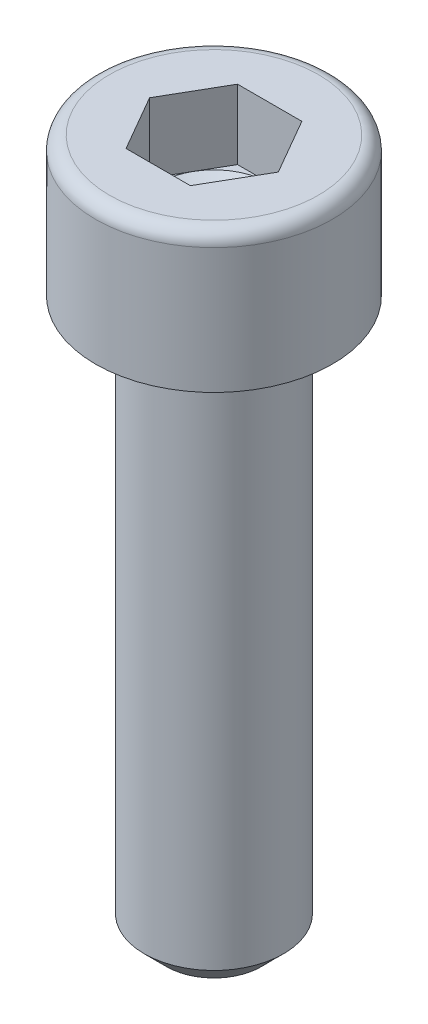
ISO-10303-21;
HEADER;
FILE_DESCRIPTION(('STEP AP214'),'2;1');
FILE_NAME('part.step','',(''),(''),'','','');
FILE_SCHEMA(('AUTOMOTIVE_DESIGN { 1 0 10303 214 1 1 1 1 }'));
ENDSEC;
DATA;
#1=APPLICATION_CONTEXT('core data for automotive mechanical design processes');
#2=APPLICATION_PROTOCOL_DEFINITION('international standard','automotive_design',2000,#1);
#3=PRODUCT_CONTEXT('',#1,'mechanical');
#4=PRODUCT('Part','Part','',(#3));
#5=PRODUCT_RELATED_PRODUCT_CATEGORY('part','',(#4));
#6=PRODUCT_DEFINITION_FORMATION('','',#4);
#7=PRODUCT_DEFINITION_CONTEXT('part definition',#1,'design');
#8=PRODUCT_DEFINITION('design','',#6,#7);
#9=PRODUCT_DEFINITION_SHAPE('','',#8);
#10=(LENGTH_UNIT() NAMED_UNIT(*) SI_UNIT(.MILLI.,.METRE.));
#11=(NAMED_UNIT(*) PLANE_ANGLE_UNIT() SI_UNIT($,.RADIAN.));
#12=(NAMED_UNIT(*) SI_UNIT($,.STERADIAN.) SOLID_ANGLE_UNIT());
#13=UNCERTAINTY_MEASURE_WITH_UNIT(LENGTH_MEASURE(1.E-05),#10,'distance_accuracy_value','');
#14=(GEOMETRIC_REPRESENTATION_CONTEXT(3) GLOBAL_UNCERTAINTY_ASSIGNED_CONTEXT((#13)) GLOBAL_UNIT_ASSIGNED_CONTEXT((#10,
#11,#12)) REPRESENTATION_CONTEXT('',''));
#15=CARTESIAN_POINT('',(0.,0.,0.));
#16=DIRECTION('',(0.,0.,1.));
#17=DIRECTION('',(1.,0.,0.));
#18=AXIS2_PLACEMENT_3D('',#15,#16,#17);
#19=CARTESIAN_POINT('',(0.,-20.,0.));
#20=DIRECTION('',(0.,1.,0.));
#21=DIRECTION('',(0.,0.,1.));
#22=AXIS2_PLACEMENT_3D('',#19,#20,#21);
#23=CYLINDRICAL_SURFACE('',#22,2.5);
#24=CARTESIAN_POINT('',(0.,-19.2,0.));
#25=DIRECTION('',(0.,1.,0.));
#26=DIRECTION('',(0.,0.,1.));
#27=AXIS2_PLACEMENT_3D('',#24,#25,#26);
#28=CIRCLE('',#27,2.5);
#29=CARTESIAN_POINT('',(0.,-19.2,2.50000000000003));
#30=VERTEX_POINT('',#29);
#31=EDGE_CURVE('E42',#30,#30,#28,.T.);
#32=ORIENTED_EDGE('',*,*,#31,.T.);
#33=EDGE_LOOP('',(#32));
#34=FACE_BOUND('',#33,.T.);
#35=CARTESIAN_POINT('',(0.,0.,0.));
#36=DIRECTION('',(0.,1.,0.));
#37=DIRECTION('',(0.,0.,1.));
#38=AXIS2_PLACEMENT_3D('',#35,#36,#37);
#39=CIRCLE('',#38,2.5);
#40=CARTESIAN_POINT('',(0.,0.,2.50000000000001));
#41=VERTEX_POINT('',#40);
#42=EDGE_CURVE('E188',#41,#41,#39,.T.);
#43=ORIENTED_EDGE('',*,*,#42,.F.);
#44=EDGE_LOOP('',(#43));
#45=FACE_BOUND('',#44,.T.);
#46=ADVANCED_FACE('F34',(#34,#45),#23,.T.);
#47=CARTESIAN_POINT('',(0.,-20.,0.));
#48=DIRECTION('',(0.,1.,0.));
#49=DIRECTION('',(0.,0.,1.));
#50=AXIS2_PLACEMENT_3D('',#47,#48,#49);
#51=PLANE('',#50);
#52=CARTESIAN_POINT('',(0.,-20.,0.));
#53=DIRECTION('',(0.,1.,0.));
#54=DIRECTION('',(0.,0.,1.));
#55=AXIS2_PLACEMENT_3D('',#52,#53,#54);
#56=CIRCLE('',#55,1.69999999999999);
#57=CARTESIAN_POINT('',(0.,-20.,1.70000000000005));
#58=VERTEX_POINT('',#57);
#59=EDGE_CURVE('E11',#58,#58,#56,.F.);
#60=ORIENTED_EDGE('',*,*,#59,.T.);
#61=EDGE_LOOP('',(#60));
#62=FACE_BOUND('',#61,.T.);
#63=ADVANCED_FACE('F197',(#62),#51,.F.);
#64=CARTESIAN_POINT('',(0.,-19.2,0.));
#65=DIRECTION('',(0.,1.,0.));
#66=DIRECTION('',(0.,0.,1.));
#67=AXIS2_PLACEMENT_3D('',#64,#65,#66);
#68=CONICAL_SURFACE('',#67,2.5,0.785398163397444);
#69=ORIENTED_EDGE('',*,*,#59,.F.);
#70=EDGE_LOOP('',(#69));
#71=FACE_BOUND('',#70,.T.);
#72=ORIENTED_EDGE('',*,*,#31,.F.);
#73=EDGE_LOOP('',(#72));
#74=FACE_BOUND('',#73,.T.);
#75=ADVANCED_FACE('F36',(#71,#74),#68,.T.);
#76=CARTESIAN_POINT('',(0.,0.,0.));
#77=DIRECTION('',(0.,1.,0.));
#78=DIRECTION('',(0.,0.,1.));
#79=AXIS2_PLACEMENT_3D('',#76,#77,#78);
#80=PLANE('',#79);
#81=ORIENTED_EDGE('',*,*,#42,.T.);
#82=EDGE_LOOP('',(#81));
#83=FACE_BOUND('',#82,.T.);
#84=CARTESIAN_POINT('',(0.,0.,0.));
#85=DIRECTION('',(0.,1.,0.));
#86=DIRECTION('',(0.,0.,1.));
#87=AXIS2_PLACEMENT_3D('',#84,#85,#86);
#88=CIRCLE('',#87,4.25);
#89=CARTESIAN_POINT('',(0.,0.,4.25000000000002));
#90=VERTEX_POINT('',#89);
#91=EDGE_CURVE('E185',#90,#90,#88,.T.);
#92=ORIENTED_EDGE('',*,*,#91,.F.);
#93=EDGE_LOOP('',(#92));
#94=FACE_BOUND('',#93,.T.);
#95=ADVANCED_FACE('F196',(#83,#94),#80,.F.);
#96=CARTESIAN_POINT('',(1.2490009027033E-13,5.,0.));
#97=DIRECTION('',(0.,1.,0.));
#98=DIRECTION('',(0.,0.,1.));
#99=AXIS2_PLACEMENT_3D('',#96,#97,#98);
#100=CYLINDRICAL_SURFACE('',#99,4.25);
#101=CARTESIAN_POINT('',(0.,4.5,0.));
#102=DIRECTION('',(0.,1.,0.));
#103=DIRECTION('',(0.,0.,1.));
#104=AXIS2_PLACEMENT_3D('',#101,#102,#103);
#105=CIRCLE('',#104,4.25);
#106=CARTESIAN_POINT('',(0.,4.5,4.25000000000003));
#107=VERTEX_POINT('',#106);
#108=EDGE_CURVE('E182',#107,#107,#105,.T.);
#109=ORIENTED_EDGE('',*,*,#108,.F.);
#110=EDGE_LOOP('',(#109));
#111=FACE_BOUND('',#110,.T.);
#112=ORIENTED_EDGE('',*,*,#91,.T.);
#113=EDGE_LOOP('',(#112));
#114=FACE_BOUND('',#113,.T.);
#115=ADVANCED_FACE('F203',(#111,#114),#100,.T.);
#116=CARTESIAN_POINT('',(0.,4.5,0.));
#117=DIRECTION('',(0.,1.,0.));
#118=DIRECTION('',(0.,0.,1.));
#119=AXIS2_PLACEMENT_3D('',#116,#117,#118);
#120=TOROIDAL_SURFACE('',#119,3.75,0.5);
#121=CARTESIAN_POINT('',(1.2490009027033E-13,5.,0.));
#122=DIRECTION('',(0.,1.,0.));
#123=DIRECTION('',(0.,0.,1.));
#124=AXIS2_PLACEMENT_3D('',#121,#122,#123);
#125=CIRCLE('',#124,3.75);
#126=CARTESIAN_POINT('',(1.24691923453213E-13,5.,3.75000000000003));
#127=VERTEX_POINT('',#126);
#128=EDGE_CURVE('E178',#127,#127,#125,.T.);
#129=ORIENTED_EDGE('',*,*,#128,.F.);
#130=EDGE_LOOP('',(#129));
#131=FACE_BOUND('',#130,.T.);
#132=ORIENTED_EDGE('',*,*,#108,.T.);
#133=EDGE_LOOP('',(#132));
#134=FACE_BOUND('',#133,.T.);
#135=ADVANCED_FACE('F215',(#131,#134),#120,.T.);
#136=CARTESIAN_POINT('',(2.00000000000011,5.,0.));
#137=DIRECTION('',(0.,-1.,0.));
#138=DIRECTION('',(0.,0.,-1.));
#139=AXIS2_PLACEMENT_3D('',#136,#137,#138);
#140=PLANE('',#139);
#141=DIRECTION('',(-1.,0.,0.));
#142=VECTOR('',#141,1.);
#143=CARTESIAN_POINT('',(-1.1547005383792,5.,-1.99999999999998));
#144=LINE('',#143,#142);
#145=CARTESIAN_POINT('',(1.15470053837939,5.,-1.99999999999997));
#146=VERTEX_POINT('',#145);
#147=CARTESIAN_POINT('',(-1.1547005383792,5.,-1.99999999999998));
#148=VERTEX_POINT('',#147);
#149=EDGE_CURVE('E49',#146,#148,#144,.T.);
#150=ORIENTED_EDGE('',*,*,#149,.F.);
#151=DIRECTION('',(-0.5,0.,-0.866025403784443));
#152=VECTOR('',#151,1.);
#153=CARTESIAN_POINT('',(1.15470053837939,5.,-1.99999999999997));
#154=LINE('',#153,#152);
#155=CARTESIAN_POINT('',(2.30940107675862,5.,0.));
#156=VERTEX_POINT('',#155);
#157=EDGE_CURVE('E125',#156,#146,#154,.T.);
#158=ORIENTED_EDGE('',*,*,#157,.F.);
#159=DIRECTION('',(0.5,0.,-0.866025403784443));
#160=VECTOR('',#159,1.);
#161=CARTESIAN_POINT('',(1.15470053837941,5.,2.00000000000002));
#162=LINE('',#161,#160);
#163=CARTESIAN_POINT('',(1.15470053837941,5.,2.00000000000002));
#164=VERTEX_POINT('',#163);
#165=EDGE_CURVE('E119',#164,#156,#162,.T.);
#166=ORIENTED_EDGE('',*,*,#165,.F.);
#167=DIRECTION('',(1.,0.,0.));
#168=VECTOR('',#167,1.);
#169=CARTESIAN_POINT('',(-1.15470053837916,5.,2.00000000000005));
#170=LINE('',#169,#168);
#171=CARTESIAN_POINT('',(-1.15470053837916,5.,2.00000000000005));
#172=VERTEX_POINT('',#171);
#173=EDGE_CURVE('E156',#172,#164,#170,.T.);
#174=ORIENTED_EDGE('',*,*,#173,.F.);
#175=DIRECTION('',(0.499999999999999,0.,0.866025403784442));
#176=VECTOR('',#175,1.);
#177=CARTESIAN_POINT('',(-1.15470053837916,5.,2.00000000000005));
#178=LINE('',#177,#176);
#179=CARTESIAN_POINT('',(-2.30940107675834,5.,0.));
#180=VERTEX_POINT('',#179);
#181=EDGE_CURVE('E154',#180,#172,#178,.T.);
#182=ORIENTED_EDGE('',*,*,#181,.F.);
#183=DIRECTION('',(-0.499999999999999,0.,0.866025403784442));
#184=VECTOR('',#183,1.);
#185=CARTESIAN_POINT('',(-1.1547005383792,5.,-1.99999999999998));
#186=LINE('',#185,#184);
#187=EDGE_CURVE('E151',#148,#180,#186,.T.);
#188=ORIENTED_EDGE('',*,*,#187,.F.);
#189=EDGE_LOOP('',(#150,#158,#166,#174,#182,#188));
#190=FACE_BOUND('',#189,.T.);
#191=ORIENTED_EDGE('',*,*,#128,.T.);
#192=EDGE_LOOP('',(#191));
#193=FACE_BOUND('',#192,.T.);
#194=ADVANCED_FACE('F219',(#190,#193),#140,.F.);
#195=CARTESIAN_POINT('',(1.15470053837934,2.5,-1.99999999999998));
#196=DIRECTION('',(0.866025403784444,0.,-0.5));
#197=DIRECTION('',(-0.5,0.,-0.866025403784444));
#198=AXIS2_PLACEMENT_3D('',#195,#196,#197);
#199=PLANE('',#198);
#200=ORIENTED_EDGE('',*,*,#157,.T.);
#201=DIRECTION('',(0.,1.,0.));
#202=VECTOR('',#201,1.);
#203=CARTESIAN_POINT('',(1.15470053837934,2.5,-1.99999999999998));
#204=LINE('',#203,#202);
#205=CARTESIAN_POINT('',(1.15470053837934,2.5,-1.99999999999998));
#206=VERTEX_POINT('',#205);
#207=EDGE_CURVE('E122',#206,#146,#204,.T.);
#208=ORIENTED_EDGE('',*,*,#207,.F.);
#209=DIRECTION('',(-0.5,0.,-0.866025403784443));
#210=VECTOR('',#209,1.);
#211=CARTESIAN_POINT('',(1.15470053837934,2.5,-1.99999999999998));
#212=LINE('',#211,#210);
#213=CARTESIAN_POINT('',(1.73205080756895,2.5,-0.999999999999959));
#214=VERTEX_POINT('',#213);
#215=EDGE_CURVE('E108',#214,#206,#212,.T.);
#216=ORIENTED_EDGE('',*,*,#215,.F.);
#217=CARTESIAN_POINT('',(2.30940107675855,2.5,0.));
#218=VERTEX_POINT('',#217);
#219=EDGE_CURVE('E118',#218,#214,#212,.T.);
#220=ORIENTED_EDGE('',*,*,#219,.F.);
#221=DIRECTION('',(0.,1.,0.));
#222=VECTOR('',#221,1.);
#223=CARTESIAN_POINT('',(2.30940107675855,2.5,0.));
#224=LINE('',#223,#222);
#225=EDGE_CURVE('E161',#218,#156,#224,.T.);
#226=ORIENTED_EDGE('',*,*,#225,.T.);
#227=EDGE_LOOP('',(#200,#208,#216,#220,#226));
#228=FACE_BOUND('',#227,.T.);
#229=ADVANCED_FACE('F123',(#228),#199,.F.);
#230=CARTESIAN_POINT('',(1.15470053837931,2.5,2.00000000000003));
#231=DIRECTION('',(0.866025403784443,0.,0.5));
#232=DIRECTION('',(0.5,0.,-0.866025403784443));
#233=AXIS2_PLACEMENT_3D('',#230,#231,#232);
#234=PLANE('',#233);
#235=ORIENTED_EDGE('',*,*,#165,.T.);
#236=ORIENTED_EDGE('',*,*,#225,.F.);
#237=DIRECTION('',(0.5,0.,-0.866025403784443));
#238=VECTOR('',#237,1.);
#239=CARTESIAN_POINT('',(1.15470053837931,2.5,2.00000000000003));
#240=LINE('',#239,#238);
#241=CARTESIAN_POINT('',(1.73205080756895,2.5,1.00000000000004));
#242=VERTEX_POINT('',#241);
#243=EDGE_CURVE('E147',#242,#218,#240,.T.);
#244=ORIENTED_EDGE('',*,*,#243,.F.);
#245=CARTESIAN_POINT('',(1.15470053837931,2.5,2.00000000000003));
#246=VERTEX_POINT('',#245);
#247=EDGE_CURVE('E57',#246,#242,#240,.T.);
#248=ORIENTED_EDGE('',*,*,#247,.F.);
#249=DIRECTION('',(0.,1.,0.));
#250=VECTOR('',#249,1.);
#251=CARTESIAN_POINT('',(1.15470053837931,2.5,2.00000000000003));
#252=LINE('',#251,#250);
#253=EDGE_CURVE('E164',#246,#164,#252,.T.);
#254=ORIENTED_EDGE('',*,*,#253,.T.);
#255=EDGE_LOOP('',(#235,#236,#244,#248,#254));
#256=FACE_BOUND('',#255,.T.);
#257=ADVANCED_FACE('F230',(#256),#234,.F.);
#258=CARTESIAN_POINT('',(-1.15470053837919,2.5,2.00000000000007));
#259=DIRECTION('',(0.,0.,1.));
#260=DIRECTION('',(1.,0.,0.));
#261=AXIS2_PLACEMENT_3D('',#258,#259,#260);
#262=PLANE('',#261);
#263=ORIENTED_EDGE('',*,*,#173,.T.);
#264=ORIENTED_EDGE('',*,*,#253,.F.);
#265=DIRECTION('',(1.,0.,0.));
#266=VECTOR('',#265,1.);
#267=CARTESIAN_POINT('',(-1.15470053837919,2.5,2.00000000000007));
#268=LINE('',#267,#266);
#269=CARTESIAN_POINT('',(0.,2.5,2.00000000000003));
#270=VERTEX_POINT('',#269);
#271=EDGE_CURVE('E143',#270,#246,#268,.T.);
#272=ORIENTED_EDGE('',*,*,#271,.F.);
#273=CARTESIAN_POINT('',(-1.15470053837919,2.5,2.00000000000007));
#274=VERTEX_POINT('',#273);
#275=EDGE_CURVE('E144',#274,#270,#268,.T.);
#276=ORIENTED_EDGE('',*,*,#275,.F.);
#277=DIRECTION('',(0.,1.,0.));
#278=VECTOR('',#277,1.);
#279=CARTESIAN_POINT('',(-1.15470053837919,2.5,2.00000000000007));
#280=LINE('',#279,#278);
#281=EDGE_CURVE('E167',#274,#172,#280,.T.);
#282=ORIENTED_EDGE('',*,*,#281,.T.);
#283=EDGE_LOOP('',(#263,#264,#272,#276,#282));
#284=FACE_BOUND('',#283,.T.);
#285=ADVANCED_FACE('F241',(#284),#262,.F.);
#286=CARTESIAN_POINT('',(-1.15470053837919,2.5,2.00000000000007));
#287=DIRECTION('',(-0.866025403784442,0.,0.499999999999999));
#288=DIRECTION('',(0.5,0.,0.866025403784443));
#289=AXIS2_PLACEMENT_3D('',#286,#287,#288);
#290=PLANE('',#289);
#291=ORIENTED_EDGE('',*,*,#181,.T.);
#292=ORIENTED_EDGE('',*,*,#281,.F.);
#293=DIRECTION('',(0.499999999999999,0.,0.866025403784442));
#294=VECTOR('',#293,1.);
#295=CARTESIAN_POINT('',(-1.15470053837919,2.5,2.00000000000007));
#296=LINE('',#295,#294);
#297=CARTESIAN_POINT('',(-1.73205080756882,2.5,1.00000000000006));
#298=VERTEX_POINT('',#297);
#299=EDGE_CURVE('E139',#298,#274,#296,.T.);
#300=ORIENTED_EDGE('',*,*,#299,.F.);
#301=CARTESIAN_POINT('',(-2.30940107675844,2.5,0.));
#302=VERTEX_POINT('',#301);
#303=EDGE_CURVE('E140',#302,#298,#296,.T.);
#304=ORIENTED_EDGE('',*,*,#303,.F.);
#305=DIRECTION('',(0.,1.,0.));
#306=VECTOR('',#305,1.);
#307=CARTESIAN_POINT('',(-2.30940107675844,2.5,0.));
#308=LINE('',#307,#306);
#309=EDGE_CURVE('E170',#302,#180,#308,.T.);
#310=ORIENTED_EDGE('',*,*,#309,.T.);
#311=EDGE_LOOP('',(#291,#292,#300,#304,#310));
#312=FACE_BOUND('',#311,.T.);
#313=ADVANCED_FACE('F237',(#312),#290,.F.);
#314=CARTESIAN_POINT('',(-1.15470053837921,2.5,-1.99999999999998));
#315=DIRECTION('',(-0.866025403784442,0.,-0.499999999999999));
#316=DIRECTION('',(-0.5,0.,0.866025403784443));
#317=AXIS2_PLACEMENT_3D('',#314,#315,#316);
#318=PLANE('',#317);
#319=ORIENTED_EDGE('',*,*,#187,.T.);
#320=ORIENTED_EDGE('',*,*,#309,.F.);
#321=DIRECTION('',(-0.499999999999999,0.,0.866025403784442));
#322=VECTOR('',#321,1.);
#323=CARTESIAN_POINT('',(-1.15470053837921,2.5,-1.99999999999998));
#324=LINE('',#323,#322);
#325=CARTESIAN_POINT('',(-1.73205080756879,2.5,-0.999999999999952));
#326=VERTEX_POINT('',#325);
#327=EDGE_CURVE('E133',#326,#302,#324,.T.);
#328=ORIENTED_EDGE('',*,*,#327,.F.);
#329=CARTESIAN_POINT('',(-1.15470053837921,2.5,-1.99999999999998));
#330=VERTEX_POINT('',#329);
#331=EDGE_CURVE('E135',#330,#326,#324,.T.);
#332=ORIENTED_EDGE('',*,*,#331,.F.);
#333=DIRECTION('',(0.,1.,0.));
#334=VECTOR('',#333,1.);
#335=CARTESIAN_POINT('',(-1.15470053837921,2.5,-1.99999999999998));
#336=LINE('',#335,#334);
#337=EDGE_CURVE('E127',#330,#148,#336,.T.);
#338=ORIENTED_EDGE('',*,*,#337,.T.);
#339=EDGE_LOOP('',(#319,#320,#328,#332,#338));
#340=FACE_BOUND('',#339,.T.);
#341=ADVANCED_FACE('F234',(#340),#318,.F.);
#342=CARTESIAN_POINT('',(-1.15470053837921,2.5,-1.99999999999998));
#343=DIRECTION('',(0.,0.,-1.));
#344=DIRECTION('',(-1.,0.,0.));
#345=AXIS2_PLACEMENT_3D('',#342,#343,#344);
#346=PLANE('',#345);
#347=ORIENTED_EDGE('',*,*,#149,.T.);
#348=ORIENTED_EDGE('',*,*,#337,.F.);
#349=DIRECTION('',(-1.,0.,0.));
#350=VECTOR('',#349,1.);
#351=CARTESIAN_POINT('',(-1.15470053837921,2.5,-1.99999999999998));
#352=LINE('',#351,#350);
#353=CARTESIAN_POINT('',(0.,2.5,-1.99999999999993));
#354=VERTEX_POINT('',#353);
#355=EDGE_CURVE('E132',#354,#330,#352,.T.);
#356=ORIENTED_EDGE('',*,*,#355,.F.);
#357=EDGE_CURVE('E112',#206,#354,#352,.T.);
#358=ORIENTED_EDGE('',*,*,#357,.F.);
#359=ORIENTED_EDGE('',*,*,#207,.T.);
#360=EDGE_LOOP('',(#347,#348,#356,#358,#359));
#361=FACE_BOUND('',#360,.T.);
#362=ADVANCED_FACE('F130',(#361),#346,.F.);
#363=CARTESIAN_POINT('',(3.46410161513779,2.5,2.00000000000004));
#364=DIRECTION('',(0.,1.,0.));
#365=DIRECTION('',(0.,0.,1.));
#366=AXIS2_PLACEMENT_3D('',#363,#364,#365);
#367=PLANE('',#366);
#368=CARTESIAN_POINT('',(0.,2.5,0.));
#369=DIRECTION('',(0.,1.,0.));
#370=DIRECTION('',(0.,0.,1.));
#371=AXIS2_PLACEMENT_3D('',#368,#369,#370);
#372=CIRCLE('',#371,2.);
#373=EDGE_CURVE('E163',#298,#270,#372,.T.);
#374=ORIENTED_EDGE('',*,*,#373,.F.);
#375=ORIENTED_EDGE('',*,*,#299,.T.);
#376=ORIENTED_EDGE('',*,*,#275,.T.);
#377=EDGE_LOOP('',(#374,#375,#376));
#378=FACE_BOUND('',#377,.T.);
#379=ADVANCED_FACE('F233',(#378),#367,.T.);
#380=EDGE_CURVE('E273',#326,#298,#372,.T.);
#381=ORIENTED_EDGE('',*,*,#380,.F.);
#382=ORIENTED_EDGE('',*,*,#327,.T.);
#383=ORIENTED_EDGE('',*,*,#303,.T.);
#384=EDGE_LOOP('',(#381,#382,#383));
#385=FACE_BOUND('',#384,.T.);
#386=ADVANCED_FACE('F250',(#385),#367,.T.);
#387=EDGE_CURVE('E274',#354,#326,#372,.T.);
#388=ORIENTED_EDGE('',*,*,#387,.F.);
#389=ORIENTED_EDGE('',*,*,#355,.T.);
#390=ORIENTED_EDGE('',*,*,#331,.T.);
#391=EDGE_LOOP('',(#388,#389,#390));
#392=FACE_BOUND('',#391,.T.);
#393=ADVANCED_FACE('F255',(#392),#367,.T.);
#394=EDGE_CURVE('E114',#214,#354,#372,.T.);
#395=ORIENTED_EDGE('',*,*,#394,.F.);
#396=ORIENTED_EDGE('',*,*,#215,.T.);
#397=ORIENTED_EDGE('',*,*,#357,.T.);
#398=EDGE_LOOP('',(#395,#396,#397));
#399=FACE_BOUND('',#398,.T.);
#400=ADVANCED_FACE('F110',(#399),#367,.T.);
#401=EDGE_CURVE('E179',#242,#214,#372,.T.);
#402=ORIENTED_EDGE('',*,*,#401,.F.);
#403=ORIENTED_EDGE('',*,*,#243,.T.);
#404=ORIENTED_EDGE('',*,*,#219,.T.);
#405=EDGE_LOOP('',(#402,#403,#404));
#406=FACE_BOUND('',#405,.T.);
#407=ADVANCED_FACE('F258',(#406),#367,.T.);
#408=EDGE_CURVE('E175',#270,#242,#372,.T.);
#409=ORIENTED_EDGE('',*,*,#408,.F.);
#410=ORIENTED_EDGE('',*,*,#271,.T.);
#411=ORIENTED_EDGE('',*,*,#247,.T.);
#412=EDGE_LOOP('',(#409,#410,#411));
#413=FACE_BOUND('',#412,.T.);
#414=ADVANCED_FACE('F226',(#413),#367,.T.);
#415=CARTESIAN_POINT('',(0.,2.5,0.));
#416=DIRECTION('',(0.,1.,0.));
#417=DIRECTION('',(0.,0.,1.));
#418=AXIS2_PLACEMENT_3D('',#415,#416,#417);
#419=CONICAL_SURFACE('',#418,2.,1.04719755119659);
#420=CARTESIAN_POINT('',(0.,1.34529946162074,0.));
#421=VERTEX_POINT('',#420);
#422=VERTEX_LOOP('',#421);
#423=FACE_BOUND('',#422,.T.);
#424=ORIENTED_EDGE('',*,*,#408,.T.);
#425=ORIENTED_EDGE('',*,*,#401,.T.);
#426=ORIENTED_EDGE('',*,*,#394,.T.);
#427=ORIENTED_EDGE('',*,*,#387,.T.);
#428=ORIENTED_EDGE('',*,*,#380,.T.);
#429=ORIENTED_EDGE('',*,*,#373,.T.);
#430=EDGE_LOOP('',(#424,#425,#426,#427,#428,#429));
#431=FACE_BOUND('',#430,.T.);
#432=ADVANCED_FACE('F223',(#423,#431),#419,.F.);
#433=CLOSED_SHELL('',(#46,#63,#75,#95,#115,#135,#194,#229,#257,#285,#313,#341,#362,#379,#386,
#393,#400,#407,#414,#432));
#434=MANIFOLD_SOLID_BREP('B2',#433);
#435=ADVANCED_BREP_SHAPE_REPRESENTATION('',(#18,#434),#14);
#436=SHAPE_DEFINITION_REPRESENTATION(#9,#435);
ENDSEC;
END-ISO-10303-21;
